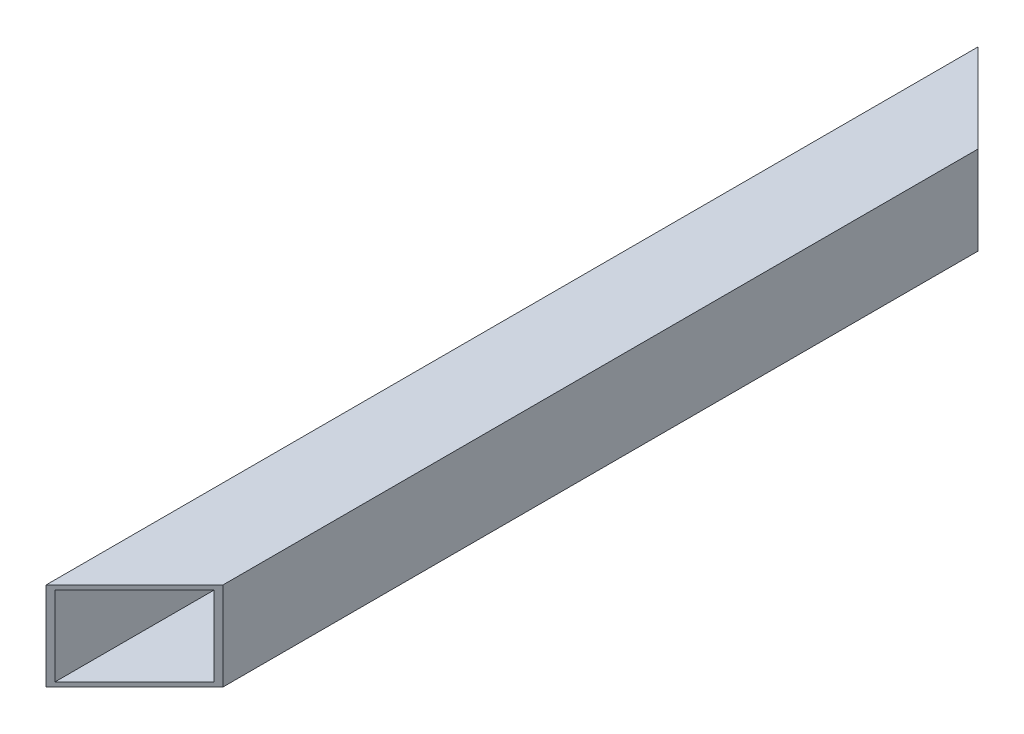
ISO-10303-21;
HEADER;
FILE_DESCRIPTION(('STEP AP214'),'2;1');
FILE_NAME('part.step','',(''),(''),'','','');
FILE_SCHEMA(('AUTOMOTIVE_DESIGN { 1 0 10303 214 1 1 1 1 }'));
ENDSEC;
DATA;
#1=APPLICATION_CONTEXT('core data for automotive mechanical design processes');
#2=APPLICATION_PROTOCOL_DEFINITION('international standard','automotive_design',2000,#1);
#3=PRODUCT_CONTEXT('',#1,'mechanical');
#4=PRODUCT('Part','Part','',(#3));
#5=PRODUCT_RELATED_PRODUCT_CATEGORY('part','',(#4));
#6=PRODUCT_DEFINITION_FORMATION('','',#4);
#7=PRODUCT_DEFINITION_CONTEXT('part definition',#1,'design');
#8=PRODUCT_DEFINITION('design','',#6,#7);
#9=PRODUCT_DEFINITION_SHAPE('','',#8);
#10=(LENGTH_UNIT() NAMED_UNIT(*) SI_UNIT(.MILLI.,.METRE.));
#11=(NAMED_UNIT(*) PLANE_ANGLE_UNIT() SI_UNIT($,.RADIAN.));
#12=(NAMED_UNIT(*) SI_UNIT($,.STERADIAN.) SOLID_ANGLE_UNIT());
#13=UNCERTAINTY_MEASURE_WITH_UNIT(LENGTH_MEASURE(1.E-05),#10,'distance_accuracy_value','');
#14=(GEOMETRIC_REPRESENTATION_CONTEXT(3) GLOBAL_UNCERTAINTY_ASSIGNED_CONTEXT((#13)) GLOBAL_UNIT_ASSIGNED_CONTEXT((#10,
#11,#12)) REPRESENTATION_CONTEXT('',''));
#15=CARTESIAN_POINT('',(0.,0.,0.));
#16=DIRECTION('',(0.,0.,1.));
#17=DIRECTION('',(1.,0.,0.));
#18=AXIS2_PLACEMENT_3D('',#15,#16,#17);
#19=CARTESIAN_POINT('',(-36.,36.,-40.));
#20=DIRECTION('',(1.,0.,0.));
#21=DIRECTION('',(0.,1.,0.));
#22=AXIS2_PLACEMENT_3D('',#19,#20,#21);
#23=PLANE('',#22);
#24=DIRECTION('',(0.,-1.,0.));
#25=VECTOR('',#24,1.);
#26=CARTESIAN_POINT('',(-36.,18.,-36.));
#27=LINE('',#26,#25);
#28=CARTESIAN_POINT('',(-36.,36.,-36.));
#29=VERTEX_POINT('',#28);
#30=CARTESIAN_POINT('',(-36.,-36.,-36.));
#31=VERTEX_POINT('',#30);
#32=EDGE_CURVE('E136',#29,#31,#27,.T.);
#33=ORIENTED_EDGE('',*,*,#32,.F.);
#34=DIRECTION('',(0.,0.,1.));
#35=VECTOR('',#34,1.);
#36=CARTESIAN_POINT('',(-36.,36.,-40.));
#37=LINE('',#36,#35);
#38=CARTESIAN_POINT('',(-36.,36.,799.1384387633));
#39=VERTEX_POINT('',#38);
#40=EDGE_CURVE('E10',#29,#39,#37,.T.);
#41=ORIENTED_EDGE('',*,*,#40,.T.);
#42=DIRECTION('',(0.,1.,0.));
#43=VECTOR('',#42,1.);
#44=CARTESIAN_POINT('',(-36.,18.,799.1384387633));
#45=LINE('',#44,#43);
#46=CARTESIAN_POINT('',(-36.,-36.,799.1384387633));
#47=VERTEX_POINT('',#46);
#48=EDGE_CURVE('E160',#47,#39,#45,.T.);
#49=ORIENTED_EDGE('',*,*,#48,.F.);
#50=DIRECTION('',(0.,0.,1.));
#51=VECTOR('',#50,1.);
#52=CARTESIAN_POINT('',(-36.,-36.,-40.));
#53=LINE('',#52,#51);
#54=EDGE_CURVE('E181',#31,#47,#53,.T.);
#55=ORIENTED_EDGE('',*,*,#54,.F.);
#56=EDGE_LOOP('',(#33,#41,#49,#55));
#57=FACE_BOUND('',#56,.T.);
#58=ADVANCED_FACE('F16',(#57),#23,.T.);
#59=CARTESIAN_POINT('',(36.,36.,-40.));
#60=DIRECTION('',(0.,-1.,0.));
#61=DIRECTION('',(0.,0.,-1.));
#62=AXIS2_PLACEMENT_3D('',#59,#60,#61);
#63=PLANE('',#62);
#64=DIRECTION('',(-0.707106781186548,0.,-0.707106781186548));
#65=VECTOR('',#64,1.);
#66=CARTESIAN_POINT('',(-1.,36.,-1.));
#67=LINE('',#66,#65);
#68=CARTESIAN_POINT('',(36.,36.,36.));
#69=VERTEX_POINT('',#68);
#70=EDGE_CURVE('E142',#69,#29,#67,.T.);
#71=ORIENTED_EDGE('',*,*,#70,.F.);
#72=DIRECTION('',(0.,0.,1.));
#73=VECTOR('',#72,1.);
#74=CARTESIAN_POINT('',(36.,36.,-40.));
#75=LINE('',#74,#73);
#76=CARTESIAN_POINT('',(36.,36.,727.1384387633));
#77=VERTEX_POINT('',#76);
#78=EDGE_CURVE('E25',#69,#77,#75,.T.);
#79=ORIENTED_EDGE('',*,*,#78,.T.);
#80=DIRECTION('',(0.707106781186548,0.,-0.707106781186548));
#81=VECTOR('',#80,1.);
#82=CARTESIAN_POINT('',(400.56921938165,36.,362.56921938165));
#83=LINE('',#82,#81);
#84=EDGE_CURVE('E169',#39,#77,#83,.T.);
#85=ORIENTED_EDGE('',*,*,#84,.F.);
#86=ORIENTED_EDGE('',*,*,#40,.F.);
#87=EDGE_LOOP('',(#71,#79,#85,#86));
#88=FACE_BOUND('',#87,.T.);
#89=ADVANCED_FACE('F204',(#88),#63,.T.);
#90=CARTESIAN_POINT('',(36.,-36.,-40.));
#91=DIRECTION('',(-1.,0.,0.));
#92=DIRECTION('',(0.,0.,1.));
#93=AXIS2_PLACEMENT_3D('',#90,#91,#92);
#94=PLANE('',#93);
#95=DIRECTION('',(0.,1.,0.));
#96=VECTOR('',#95,1.);
#97=CARTESIAN_POINT('',(36.,-18.,36.));
#98=LINE('',#97,#96);
#99=CARTESIAN_POINT('',(36.,-36.,36.));
#100=VERTEX_POINT('',#99);
#101=EDGE_CURVE('E145',#100,#69,#98,.T.);
#102=ORIENTED_EDGE('',*,*,#101,.F.);
#103=DIRECTION('',(0.,0.,1.));
#104=VECTOR('',#103,1.);
#105=CARTESIAN_POINT('',(36.,-36.,-40.));
#106=LINE('',#105,#104);
#107=CARTESIAN_POINT('',(36.,-36.,727.1384387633));
#108=VERTEX_POINT('',#107);
#109=EDGE_CURVE('E37',#100,#108,#106,.T.);
#110=ORIENTED_EDGE('',*,*,#109,.T.);
#111=DIRECTION('',(0.,-1.,0.));
#112=VECTOR('',#111,1.);
#113=CARTESIAN_POINT('',(36.,-18.,727.1384387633));
#114=LINE('',#113,#112);
#115=EDGE_CURVE('E164',#77,#108,#114,.T.);
#116=ORIENTED_EDGE('',*,*,#115,.F.);
#117=ORIENTED_EDGE('',*,*,#78,.F.);
#118=EDGE_LOOP('',(#102,#110,#116,#117));
#119=FACE_BOUND('',#118,.T.);
#120=ADVANCED_FACE('F209',(#119),#94,.T.);
#121=CARTESIAN_POINT('',(-36.,-36.,-40.));
#122=DIRECTION('',(0.,1.,0.));
#123=DIRECTION('',(1.,0.,0.));
#124=AXIS2_PLACEMENT_3D('',#121,#122,#123);
#125=PLANE('',#124);
#126=DIRECTION('',(0.707106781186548,0.,0.707106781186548));
#127=VECTOR('',#126,1.);
#128=CARTESIAN_POINT('',(-19.,-36.,-19.));
#129=LINE('',#128,#127);
#130=EDGE_CURVE('E129',#31,#100,#129,.T.);
#131=ORIENTED_EDGE('',*,*,#130,.F.);
#132=ORIENTED_EDGE('',*,*,#54,.T.);
#133=DIRECTION('',(-0.707106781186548,0.,0.707106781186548));
#134=VECTOR('',#133,1.);
#135=CARTESIAN_POINT('',(382.56921938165,-36.,380.56921938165));
#136=LINE('',#135,#134);
#137=EDGE_CURVE('E168',#108,#47,#136,.T.);
#138=ORIENTED_EDGE('',*,*,#137,.F.);
#139=ORIENTED_EDGE('',*,*,#109,.F.);
#140=EDGE_LOOP('',(#131,#132,#138,#139));
#141=FACE_BOUND('',#140,.T.);
#142=ADVANCED_FACE('F18',(#141),#125,.T.);
#143=CARTESIAN_POINT('',(40.,40.,-40.));
#144=DIRECTION('',(0.,-1.,0.));
#145=DIRECTION('',(0.,0.,-1.));
#146=AXIS2_PLACEMENT_3D('',#143,#144,#145);
#147=PLANE('',#146);
#148=DIRECTION('',(0.,0.,1.));
#149=VECTOR('',#148,1.);
#150=CARTESIAN_POINT('',(-40.,40.,-40.));
#151=LINE('',#150,#149);
#152=CARTESIAN_POINT('',(-40.,40.,-40.));
#153=VERTEX_POINT('',#152);
#154=CARTESIAN_POINT('',(-40.,40.,803.1384388));
#155=VERTEX_POINT('',#154);
#156=EDGE_CURVE('E109',#153,#155,#151,.T.);
#157=ORIENTED_EDGE('',*,*,#156,.T.);
#158=DIRECTION('',(0.707106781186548,0.,-0.707106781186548));
#159=VECTOR('',#158,1.);
#160=CARTESIAN_POINT('',(401.56921938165,40.,361.56921938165));
#161=LINE('',#160,#159);
#162=CARTESIAN_POINT('',(40.,40.,723.1384387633));
#163=VERTEX_POINT('',#162);
#164=EDGE_CURVE('E102',#155,#163,#161,.T.);
#165=ORIENTED_EDGE('',*,*,#164,.T.);
#166=DIRECTION('',(0.,0.,1.));
#167=VECTOR('',#166,1.);
#168=CARTESIAN_POINT('',(40.,40.,-40.));
#169=LINE('',#168,#167);
#170=CARTESIAN_POINT('',(40.,40.,40.));
#171=VERTEX_POINT('',#170);
#172=EDGE_CURVE('E107',#171,#163,#169,.T.);
#173=ORIENTED_EDGE('',*,*,#172,.F.);
#174=DIRECTION('',(-0.707106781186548,0.,-0.707106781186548));
#175=VECTOR('',#174,1.);
#176=CARTESIAN_POINT('',(0.,40.,0.));
#177=LINE('',#176,#175);
#178=EDGE_CURVE('E150',#171,#153,#177,.T.);
#179=ORIENTED_EDGE('',*,*,#178,.T.);
#180=EDGE_LOOP('',(#157,#165,#173,#179));
#181=FACE_BOUND('',#180,.T.);
#182=ADVANCED_FACE('F104',(#181),#147,.F.);
#183=CARTESIAN_POINT('',(-40.,40.,-40.));
#184=DIRECTION('',(1.,0.,0.));
#185=DIRECTION('',(0.,1.,0.));
#186=AXIS2_PLACEMENT_3D('',#183,#184,#185);
#187=PLANE('',#186);
#188=DIRECTION('',(0.,-1.,0.));
#189=VECTOR('',#188,1.);
#190=CARTESIAN_POINT('',(-40.,40.,-40.));
#191=LINE('',#190,#189);
#192=CARTESIAN_POINT('',(-40.,-40.,-40.));
#193=VERTEX_POINT('',#192);
#194=EDGE_CURVE('E148',#153,#193,#191,.T.);
#195=ORIENTED_EDGE('',*,*,#194,.T.);
#196=DIRECTION('',(0.,0.,1.));
#197=VECTOR('',#196,1.);
#198=CARTESIAN_POINT('',(-40.,-40.,-40.));
#199=LINE('',#198,#197);
#200=CARTESIAN_POINT('',(-40.,-40.,803.1384388));
#201=VERTEX_POINT('',#200);
#202=EDGE_CURVE('E140',#193,#201,#199,.T.);
#203=ORIENTED_EDGE('',*,*,#202,.T.);
#204=DIRECTION('',(0.,-1.,0.));
#205=VECTOR('',#204,1.);
#206=CARTESIAN_POINT('',(-40.,40.,803.1384388));
#207=LINE('',#206,#205);
#208=EDGE_CURVE('E113',#155,#201,#207,.T.);
#209=ORIENTED_EDGE('',*,*,#208,.F.);
#210=ORIENTED_EDGE('',*,*,#156,.F.);
#211=EDGE_LOOP('',(#195,#203,#209,#210));
#212=FACE_BOUND('',#211,.T.);
#213=ADVANCED_FACE('F219',(#212),#187,.F.);
#214=CARTESIAN_POINT('',(381.56921938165,0.,381.56921938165));
#215=DIRECTION('',(-0.707106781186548,0.,-0.707106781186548));
#216=DIRECTION('',(-0.707106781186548,0.,0.707106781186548));
#217=AXIS2_PLACEMENT_3D('',#214,#215,#216);
#218=PLANE('',#217);
#219=ORIENTED_EDGE('',*,*,#48,.T.);
#220=ORIENTED_EDGE('',*,*,#84,.T.);
#221=ORIENTED_EDGE('',*,*,#115,.T.);
#222=ORIENTED_EDGE('',*,*,#137,.T.);
#223=EDGE_LOOP('',(#219,#220,#221,#222));
#224=FACE_BOUND('',#223,.T.);
#225=DIRECTION('',(-0.707106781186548,0.,0.707106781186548));
#226=VECTOR('',#225,1.);
#227=CARTESIAN_POINT('',(381.56921938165,-40.,381.56921938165));
#228=LINE('',#227,#226);
#229=CARTESIAN_POINT('',(40.,-40.,723.1384387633));
#230=VERTEX_POINT('',#229);
#231=EDGE_CURVE('E119',#230,#201,#228,.T.);
#232=ORIENTED_EDGE('',*,*,#231,.F.);
#233=DIRECTION('',(0.,-1.,0.));
#234=VECTOR('',#233,1.);
#235=CARTESIAN_POINT('',(40.,-20.,723.1384387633));
#236=LINE('',#235,#234);
#237=EDGE_CURVE('E114',#163,#230,#236,.T.);
#238=ORIENTED_EDGE('',*,*,#237,.F.);
#239=ORIENTED_EDGE('',*,*,#164,.F.);
#240=ORIENTED_EDGE('',*,*,#208,.T.);
#241=EDGE_LOOP('',(#232,#238,#239,#240));
#242=FACE_BOUND('',#241,.T.);
#243=ADVANCED_FACE('F117',(#224,#242),#218,.F.);
#244=CARTESIAN_POINT('',(40.,-40.,-40.));
#245=DIRECTION('',(-1.,0.,0.));
#246=DIRECTION('',(0.,0.,1.));
#247=AXIS2_PLACEMENT_3D('',#244,#245,#246);
#248=PLANE('',#247);
#249=ORIENTED_EDGE('',*,*,#172,.T.);
#250=ORIENTED_EDGE('',*,*,#237,.T.);
#251=DIRECTION('',(0.,0.,1.));
#252=VECTOR('',#251,1.);
#253=CARTESIAN_POINT('',(40.,-40.,-40.));
#254=LINE('',#253,#252);
#255=CARTESIAN_POINT('',(40.,-40.,40.));
#256=VERTEX_POINT('',#255);
#257=EDGE_CURVE('E293',#256,#230,#254,.T.);
#258=ORIENTED_EDGE('',*,*,#257,.F.);
#259=DIRECTION('',(0.,1.,0.));
#260=VECTOR('',#259,1.);
#261=CARTESIAN_POINT('',(40.,-20.,40.));
#262=LINE('',#261,#260);
#263=EDGE_CURVE('E127',#256,#171,#262,.T.);
#264=ORIENTED_EDGE('',*,*,#263,.T.);
#265=EDGE_LOOP('',(#249,#250,#258,#264));
#266=FACE_BOUND('',#265,.T.);
#267=ADVANCED_FACE('F126',(#266),#248,.F.);
#268=CARTESIAN_POINT('',(0.,0.,0.));
#269=DIRECTION('',(-0.707106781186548,0.,0.707106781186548));
#270=DIRECTION('',(0.,1.,0.));
#271=AXIS2_PLACEMENT_3D('',#268,#269,#270);
#272=PLANE('',#271);
#273=ORIENTED_EDGE('',*,*,#101,.T.);
#274=ORIENTED_EDGE('',*,*,#70,.T.);
#275=ORIENTED_EDGE('',*,*,#32,.T.);
#276=ORIENTED_EDGE('',*,*,#130,.T.);
#277=EDGE_LOOP('',(#273,#274,#275,#276));
#278=FACE_BOUND('',#277,.T.);
#279=ORIENTED_EDGE('',*,*,#263,.F.);
#280=DIRECTION('',(0.707106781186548,0.,0.707106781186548));
#281=VECTOR('',#280,1.);
#282=CARTESIAN_POINT('',(-20.,-40.,-20.));
#283=LINE('',#282,#281);
#284=EDGE_CURVE('E149',#193,#256,#283,.T.);
#285=ORIENTED_EDGE('',*,*,#284,.F.);
#286=ORIENTED_EDGE('',*,*,#194,.F.);
#287=ORIENTED_EDGE('',*,*,#178,.F.);
#288=EDGE_LOOP('',(#279,#285,#286,#287));
#289=FACE_BOUND('',#288,.T.);
#290=ADVANCED_FACE('F197',(#278,#289),#272,.F.);
#291=CARTESIAN_POINT('',(-40.,-40.,-40.));
#292=DIRECTION('',(0.,1.,0.));
#293=DIRECTION('',(1.,0.,0.));
#294=AXIS2_PLACEMENT_3D('',#291,#292,#293);
#295=PLANE('',#294);
#296=ORIENTED_EDGE('',*,*,#257,.T.);
#297=ORIENTED_EDGE('',*,*,#231,.T.);
#298=ORIENTED_EDGE('',*,*,#202,.F.);
#299=ORIENTED_EDGE('',*,*,#284,.T.);
#300=EDGE_LOOP('',(#296,#297,#298,#299));
#301=FACE_BOUND('',#300,.T.);
#302=ADVANCED_FACE('F192',(#301),#295,.F.);
#303=CLOSED_SHELL('',(#58,#89,#120,#142,#182,#213,#243,#267,#290,#302));
#304=MANIFOLD_SOLID_BREP('B1',#303);
#305=ADVANCED_BREP_SHAPE_REPRESENTATION('',(#18,#304),#14);
#306=SHAPE_DEFINITION_REPRESENTATION(#9,#305);
ENDSEC;
END-ISO-10303-21;
